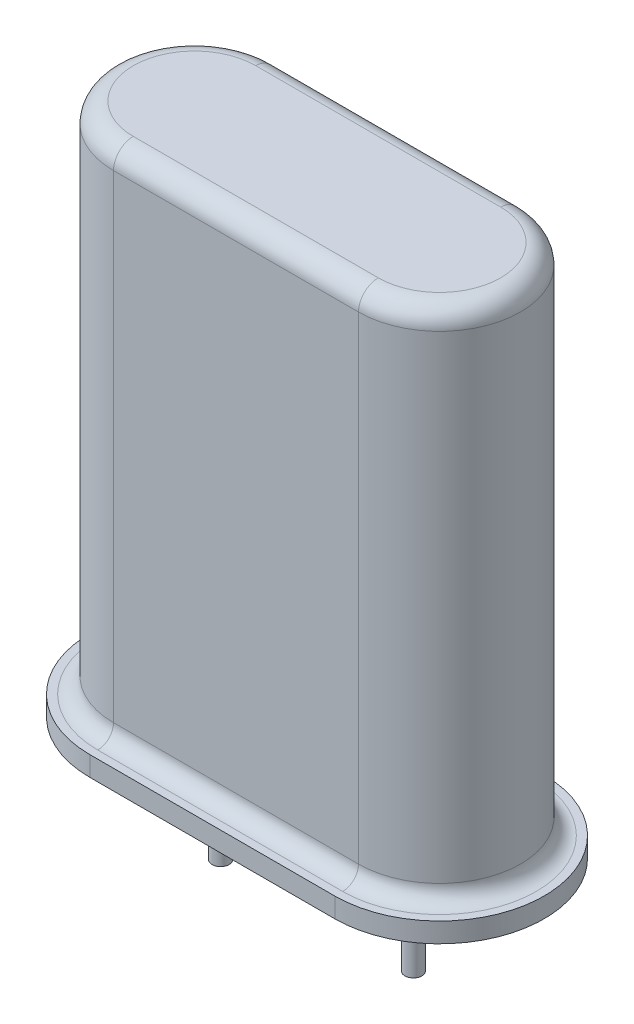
ISO-10303-21;
HEADER;
FILE_DESCRIPTION(('STEP AP214'),'2;1');
FILE_NAME('part.step','',(''),(''),'','','');
FILE_SCHEMA(('AUTOMOTIVE_DESIGN { 1 0 10303 214 1 1 1 1 }'));
ENDSEC;
DATA;
#1=APPLICATION_CONTEXT('core data for automotive mechanical design processes');
#2=APPLICATION_PROTOCOL_DEFINITION('international standard','automotive_design',2000,#1);
#3=PRODUCT_CONTEXT('',#1,'mechanical');
#4=PRODUCT('Part','Part','',(#3));
#5=PRODUCT_RELATED_PRODUCT_CATEGORY('part','',(#4));
#6=PRODUCT_DEFINITION_FORMATION('','',#4);
#7=PRODUCT_DEFINITION_CONTEXT('part definition',#1,'design');
#8=PRODUCT_DEFINITION('design','',#6,#7);
#9=PRODUCT_DEFINITION_SHAPE('','',#8);
#10=(LENGTH_UNIT() NAMED_UNIT(*) SI_UNIT(.MILLI.,.METRE.));
#11=(NAMED_UNIT(*) PLANE_ANGLE_UNIT() SI_UNIT($,.RADIAN.));
#12=(NAMED_UNIT(*) SI_UNIT($,.STERADIAN.) SOLID_ANGLE_UNIT());
#13=UNCERTAINTY_MEASURE_WITH_UNIT(LENGTH_MEASURE(1.E-05),#10,'distance_accuracy_value','');
#14=(GEOMETRIC_REPRESENTATION_CONTEXT(3) GLOBAL_UNCERTAINTY_ASSIGNED_CONTEXT((#13)) GLOBAL_UNIT_ASSIGNED_CONTEXT((#10,
#11,#12)) REPRESENTATION_CONTEXT('',''));
#15=CARTESIAN_POINT('',(0.,0.,0.));
#16=DIRECTION('',(0.,0.,1.));
#17=DIRECTION('',(1.,0.,0.));
#18=AXIS2_PLACEMENT_3D('',#15,#16,#17);
#19=CARTESIAN_POINT('',(-3.1,0.8,0.));
#20=DIRECTION('',(0.,-1.,0.));
#21=DIRECTION('',(0.,0.,-1.));
#22=AXIS2_PLACEMENT_3D('',#19,#20,#21);
#23=PLANE('',#22);
#24=DIRECTION('',(1.,0.,0.));
#25=VECTOR('',#24,1.);
#26=CARTESIAN_POINT('',(-3.1,0.8,2.45));
#27=LINE('',#26,#25);
#28=CARTESIAN_POINT('',(3.1,0.8,2.45));
#29=VERTEX_POINT('',#28);
#30=CARTESIAN_POINT('',(-3.1,0.8,2.45));
#31=VERTEX_POINT('',#30);
#32=EDGE_CURVE('E187',#29,#31,#27,.F.);
#33=ORIENTED_EDGE('',*,*,#32,.T.);
#34=CARTESIAN_POINT('',(-3.1,0.8,0.));
#35=DIRECTION('',(0.,-1.,0.));
#36=DIRECTION('',(0.,0.,-1.));
#37=AXIS2_PLACEMENT_3D('',#34,#35,#36);
#38=CIRCLE('',#37,2.45);
#39=CARTESIAN_POINT('',(-3.1,0.8,-2.45));
#40=VERTEX_POINT('',#39);
#41=EDGE_CURVE('E196',#31,#40,#38,.T.);
#42=ORIENTED_EDGE('',*,*,#41,.T.);
#43=DIRECTION('',(-1.,0.,0.));
#44=VECTOR('',#43,1.);
#45=CARTESIAN_POINT('',(3.1,0.8,-2.45));
#46=LINE('',#45,#44);
#47=CARTESIAN_POINT('',(3.1,0.8,-2.45));
#48=VERTEX_POINT('',#47);
#49=EDGE_CURVE('E193',#40,#48,#46,.F.);
#50=ORIENTED_EDGE('',*,*,#49,.T.);
#51=CARTESIAN_POINT('',(3.1,0.8,0.));
#52=DIRECTION('',(0.,-1.,0.));
#53=DIRECTION('',(0.,0.,-1.));
#54=AXIS2_PLACEMENT_3D('',#51,#52,#53);
#55=CIRCLE('',#54,2.45);
#56=EDGE_CURVE('E190',#48,#29,#55,.T.);
#57=ORIENTED_EDGE('',*,*,#56,.T.);
#58=EDGE_LOOP('',(#33,#42,#50,#57));
#59=FACE_BOUND('',#58,.T.);
#60=CARTESIAN_POINT('',(-3.1,0.8,0.));
#61=DIRECTION('',(0.,1.,0.));
#62=DIRECTION('',(0.,0.,-1.));
#63=AXIS2_PLACEMENT_3D('',#60,#61,#62);
#64=CIRCLE('',#63,2.65);
#65=CARTESIAN_POINT('',(-3.1,0.8,-2.65));
#66=VERTEX_POINT('',#65);
#67=CARTESIAN_POINT('',(-3.1,0.8,2.65));
#68=VERTEX_POINT('',#67);
#69=EDGE_CURVE('E140',#66,#68,#64,.T.);
#70=ORIENTED_EDGE('',*,*,#69,.T.);
#71=DIRECTION('',(1.,0.,0.));
#72=VECTOR('',#71,1.);
#73=CARTESIAN_POINT('',(-3.1,0.8,2.65));
#74=LINE('',#73,#72);
#75=CARTESIAN_POINT('',(3.1,0.8,2.65));
#76=VERTEX_POINT('',#75);
#77=EDGE_CURVE('E128',#68,#76,#74,.T.);
#78=ORIENTED_EDGE('',*,*,#77,.T.);
#79=CARTESIAN_POINT('',(3.1,0.8,0.));
#80=DIRECTION('',(0.,1.,0.));
#81=DIRECTION('',(0.,0.,1.));
#82=AXIS2_PLACEMENT_3D('',#79,#80,#81);
#83=CIRCLE('',#82,2.65);
#84=CARTESIAN_POINT('',(3.1,0.8,-2.65));
#85=VERTEX_POINT('',#84);
#86=EDGE_CURVE('E139',#76,#85,#83,.T.);
#87=ORIENTED_EDGE('',*,*,#86,.T.);
#88=DIRECTION('',(-1.,0.,0.));
#89=VECTOR('',#88,1.);
#90=CARTESIAN_POINT('',(-3.1,0.8,-2.65));
#91=LINE('',#90,#89);
#92=EDGE_CURVE('E144',#85,#66,#91,.T.);
#93=ORIENTED_EDGE('',*,*,#92,.T.);
#94=EDGE_LOOP('',(#70,#78,#87,#93));
#95=FACE_BOUND('',#94,.T.);
#96=ADVANCED_FACE('F38',(#59,#95),#23,.F.);
#97=CARTESIAN_POINT('',(-2.44,-2.5,0.));
#98=DIRECTION('',(0.,-1.,0.));
#99=DIRECTION('',(0.,0.,-1.));
#100=AXIS2_PLACEMENT_3D('',#97,#98,#99);
#101=PLANE('',#100);
#102=CARTESIAN_POINT('',(-2.44,-2.5,0.));
#103=DIRECTION('',(0.,-1.,0.));
#104=DIRECTION('',(0.,0.,-1.));
#105=AXIS2_PLACEMENT_3D('',#102,#103,#104);
#106=CIRCLE('',#105,0.215);
#107=CARTESIAN_POINT('',(-2.44,-2.5,-0.215));
#108=VERTEX_POINT('',#107);
#109=EDGE_CURVE('E175',#108,#108,#106,.T.);
#110=ORIENTED_EDGE('',*,*,#109,.T.);
#111=EDGE_LOOP('',(#110));
#112=FACE_BOUND('',#111,.T.);
#113=ADVANCED_FACE('F331',(#112),#101,.T.);
#114=CARTESIAN_POINT('',(-2.44,-2.5,0.));
#115=DIRECTION('',(0.,-1.,0.));
#116=DIRECTION('',(0.,0.,-1.));
#117=AXIS2_PLACEMENT_3D('',#114,#115,#116);
#118=CYLINDRICAL_SURFACE('',#117,0.215);
#119=CARTESIAN_POINT('',(-2.44,0.,0.));
#120=DIRECTION('',(0.,-1.,0.));
#121=DIRECTION('',(0.,0.,-1.));
#122=AXIS2_PLACEMENT_3D('',#119,#120,#121);
#123=CIRCLE('',#122,0.215);
#124=CARTESIAN_POINT('',(-2.44,0.,-0.215));
#125=VERTEX_POINT('',#124);
#126=EDGE_CURVE('E171',#125,#125,#123,.T.);
#127=ORIENTED_EDGE('',*,*,#126,.T.);
#128=EDGE_LOOP('',(#127));
#129=FACE_BOUND('',#128,.T.);
#130=ORIENTED_EDGE('',*,*,#109,.F.);
#131=EDGE_LOOP('',(#130));
#132=FACE_BOUND('',#131,.T.);
#133=ADVANCED_FACE('F337',(#129,#132),#118,.T.);
#134=CARTESIAN_POINT('',(-2.225,0.,0.));
#135=DIRECTION('',(0.,-1.,0.));
#136=DIRECTION('',(0.,0.,-1.));
#137=AXIS2_PLACEMENT_3D('',#134,#135,#136);
#138=PLANE('',#137);
#139=CARTESIAN_POINT('',(-2.44,0.,0.));
#140=DIRECTION('',(0.,-1.,0.));
#141=DIRECTION('',(0.,0.,-1.));
#142=AXIS2_PLACEMENT_3D('',#139,#140,#141);
#143=CIRCLE('',#142,0.312701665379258);
#144=CARTESIAN_POINT('',(-2.44,0.,-0.312701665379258));
#145=VERTEX_POINT('',#144);
#146=EDGE_CURVE('E161',#145,#145,#143,.T.);
#147=ORIENTED_EDGE('',*,*,#146,.T.);
#148=EDGE_LOOP('',(#147));
#149=FACE_BOUND('',#148,.T.);
#150=ORIENTED_EDGE('',*,*,#126,.F.);
#151=EDGE_LOOP('',(#150));
#152=FACE_BOUND('',#151,.T.);
#153=ADVANCED_FACE('F359',(#149,#152),#138,.T.);
#154=CARTESIAN_POINT('',(-2.44,0.4,0.));
#155=DIRECTION('',(0.,-1.,0.));
#156=DIRECTION('',(0.,0.,-1.));
#157=AXIS2_PLACEMENT_3D('',#154,#155,#156);
#158=DEGENERATE_TOROIDAL_SURFACE('',#157,0.312701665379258,0.4,.T.);
#159=CARTESIAN_POINT('',(-2.44,0.3,0.));
#160=DIRECTION('',(0.,-1.,0.));
#161=DIRECTION('',(0.,0.,-1.));
#162=AXIS2_PLACEMENT_3D('',#159,#160,#161);
#163=CIRCLE('',#162,0.7);
#164=CARTESIAN_POINT('',(-2.44,0.3,-0.7));
#165=VERTEX_POINT('',#164);
#166=EDGE_CURVE('E155',#165,#165,#163,.F.);
#167=ORIENTED_EDGE('',*,*,#166,.F.);
#168=EDGE_LOOP('',(#167));
#169=FACE_BOUND('',#168,.T.);
#170=ORIENTED_EDGE('',*,*,#146,.F.);
#171=EDGE_LOOP('',(#170));
#172=FACE_BOUND('',#171,.T.);
#173=ADVANCED_FACE('F356',(#169,#172),#158,.T.);
#174=CARTESIAN_POINT('',(-3.1,0.8,0.));
#175=DIRECTION('',(0.,-1.,0.));
#176=DIRECTION('',(0.,0.,-1.));
#177=AXIS2_PLACEMENT_3D('',#174,#175,#176);
#178=CYLINDRICAL_SURFACE('',#177,2.65);
#179=CARTESIAN_POINT('',(-3.1,0.3,0.));
#180=DIRECTION('',(0.,1.,0.));
#181=DIRECTION('',(0.,0.,-1.));
#182=AXIS2_PLACEMENT_3D('',#179,#180,#181);
#183=CIRCLE('',#182,2.65);
#184=CARTESIAN_POINT('',(-3.1,0.3,-2.65));
#185=VERTEX_POINT('',#184);
#186=CARTESIAN_POINT('',(-3.1,0.3,2.65));
#187=VERTEX_POINT('',#186);
#188=EDGE_CURVE('E153',#185,#187,#183,.T.);
#189=ORIENTED_EDGE('',*,*,#188,.T.);
#190=DIRECTION('',(0.,-1.,0.));
#191=VECTOR('',#190,1.);
#192=CARTESIAN_POINT('',(-3.1,0.8,2.65));
#193=LINE('',#192,#191);
#194=EDGE_CURVE('E132',#68,#187,#193,.T.);
#195=ORIENTED_EDGE('',*,*,#194,.F.);
#196=ORIENTED_EDGE('',*,*,#69,.F.);
#197=DIRECTION('',(0.,-1.,0.));
#198=VECTOR('',#197,1.);
#199=CARTESIAN_POINT('',(-3.1,0.8,-2.65));
#200=LINE('',#199,#198);
#201=EDGE_CURVE('E302',#66,#185,#200,.T.);
#202=ORIENTED_EDGE('',*,*,#201,.T.);
#203=EDGE_LOOP('',(#189,#195,#196,#202));
#204=FACE_BOUND('',#203,.T.);
#205=ADVANCED_FACE('F151',(#204),#178,.T.);
#206=CARTESIAN_POINT('',(-3.1,0.8,2.65));
#207=DIRECTION('',(0.,0.,-1.));
#208=DIRECTION('',(-1.,0.,0.));
#209=AXIS2_PLACEMENT_3D('',#206,#207,#208);
#210=PLANE('',#209);
#211=DIRECTION('',(1.,0.,0.));
#212=VECTOR('',#211,1.);
#213=CARTESIAN_POINT('',(-3.1,0.3,2.65));
#214=LINE('',#213,#212);
#215=CARTESIAN_POINT('',(3.1,0.3,2.65));
#216=VERTEX_POINT('',#215);
#217=EDGE_CURVE('E304',#187,#216,#214,.T.);
#218=ORIENTED_EDGE('',*,*,#217,.T.);
#219=DIRECTION('',(0.,-1.,0.));
#220=VECTOR('',#219,1.);
#221=CARTESIAN_POINT('',(3.1,0.8,2.65));
#222=LINE('',#221,#220);
#223=EDGE_CURVE('E135',#76,#216,#222,.T.);
#224=ORIENTED_EDGE('',*,*,#223,.F.);
#225=ORIENTED_EDGE('',*,*,#77,.F.);
#226=ORIENTED_EDGE('',*,*,#194,.T.);
#227=EDGE_LOOP('',(#218,#224,#225,#226));
#228=FACE_BOUND('',#227,.T.);
#229=ADVANCED_FACE('F130',(#228),#210,.F.);
#230=CARTESIAN_POINT('',(3.1,0.8,0.));
#231=DIRECTION('',(0.,-1.,0.));
#232=DIRECTION('',(0.,0.,-1.));
#233=AXIS2_PLACEMENT_3D('',#230,#231,#232);
#234=CYLINDRICAL_SURFACE('',#233,2.65);
#235=CARTESIAN_POINT('',(3.1,0.3,0.));
#236=DIRECTION('',(0.,1.,0.));
#237=DIRECTION('',(0.,0.,1.));
#238=AXIS2_PLACEMENT_3D('',#235,#236,#237);
#239=CIRCLE('',#238,2.65);
#240=CARTESIAN_POINT('',(3.1,0.3,-2.65));
#241=VERTEX_POINT('',#240);
#242=EDGE_CURVE('E307',#216,#241,#239,.T.);
#243=ORIENTED_EDGE('',*,*,#242,.T.);
#244=DIRECTION('',(0.,-1.,0.));
#245=VECTOR('',#244,1.);
#246=CARTESIAN_POINT('',(3.1,0.8,-2.65));
#247=LINE('',#246,#245);
#248=EDGE_CURVE('E164',#85,#241,#247,.T.);
#249=ORIENTED_EDGE('',*,*,#248,.F.);
#250=ORIENTED_EDGE('',*,*,#86,.F.);
#251=ORIENTED_EDGE('',*,*,#223,.T.);
#252=EDGE_LOOP('',(#243,#249,#250,#251));
#253=FACE_BOUND('',#252,.T.);
#254=ADVANCED_FACE('F321',(#253),#234,.T.);
#255=CARTESIAN_POINT('',(-3.1,0.8,-2.65));
#256=DIRECTION('',(0.,0.,1.));
#257=DIRECTION('',(1.,0.,0.));
#258=AXIS2_PLACEMENT_3D('',#255,#256,#257);
#259=PLANE('',#258);
#260=DIRECTION('',(-1.,0.,0.));
#261=VECTOR('',#260,1.);
#262=CARTESIAN_POINT('',(-3.1,0.3,-2.65));
#263=LINE('',#262,#261);
#264=EDGE_CURVE('E149',#241,#185,#263,.T.);
#265=ORIENTED_EDGE('',*,*,#264,.T.);
#266=ORIENTED_EDGE('',*,*,#201,.F.);
#267=ORIENTED_EDGE('',*,*,#92,.F.);
#268=ORIENTED_EDGE('',*,*,#248,.T.);
#269=EDGE_LOOP('',(#265,#266,#267,#268));
#270=FACE_BOUND('',#269,.T.);
#271=ADVANCED_FACE('F316',(#270),#259,.F.);
#272=CARTESIAN_POINT('',(-3.1,0.3,0.));
#273=DIRECTION('',(0.,-1.,0.));
#274=DIRECTION('',(0.,0.,-1.));
#275=AXIS2_PLACEMENT_3D('',#272,#273,#274);
#276=PLANE('',#275);
#277=CARTESIAN_POINT('',(2.44,0.3,0.));
#278=DIRECTION('',(0.,-1.,0.));
#279=DIRECTION('',(0.,0.,-1.));
#280=AXIS2_PLACEMENT_3D('',#277,#278,#279);
#281=CIRCLE('',#280,0.7);
#282=CARTESIAN_POINT('',(2.44,0.3,-0.7));
#283=VERTEX_POINT('',#282);
#284=EDGE_CURVE('E179',#283,#283,#281,.T.);
#285=ORIENTED_EDGE('',*,*,#284,.F.);
#286=EDGE_LOOP('',(#285));
#287=FACE_BOUND('',#286,.T.);
#288=ORIENTED_EDGE('',*,*,#166,.T.);
#289=EDGE_LOOP('',(#288));
#290=FACE_BOUND('',#289,.T.);
#291=ORIENTED_EDGE('',*,*,#188,.F.);
#292=ORIENTED_EDGE('',*,*,#264,.F.);
#293=ORIENTED_EDGE('',*,*,#242,.F.);
#294=ORIENTED_EDGE('',*,*,#217,.F.);
#295=EDGE_LOOP('',(#291,#292,#293,#294));
#296=FACE_BOUND('',#295,.T.);
#297=ADVANCED_FACE('F320',(#287,#290,#296),#276,.T.);
#298=CARTESIAN_POINT('',(3.1,38.3860272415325,-2.05));
#299=DIRECTION('',(0.,0.,1.));
#300=DIRECTION('',(1.,0.,0.));
#301=AXIS2_PLACEMENT_3D('',#298,#299,#300);
#302=PLANE('',#301);
#303=DIRECTION('',(0.,-1.,0.));
#304=VECTOR('',#303,1.);
#305=CARTESIAN_POINT('',(-3.1,38.3860272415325,-2.05));
#306=LINE('',#305,#304);
#307=CARTESIAN_POINT('',(-3.1,13.3,-2.05));
#308=VERTEX_POINT('',#307);
#309=CARTESIAN_POINT('',(-3.1,1.2,-2.05));
#310=VERTEX_POINT('',#309);
#311=EDGE_CURVE('E294',#308,#310,#306,.T.);
#312=ORIENTED_EDGE('',*,*,#311,.F.);
#313=DIRECTION('',(1.,0.,0.));
#314=VECTOR('',#313,1.);
#315=CARTESIAN_POINT('',(3.1,13.3,-2.05));
#316=LINE('',#315,#314);
#317=CARTESIAN_POINT('',(3.1,13.3,-2.05));
#318=VERTEX_POINT('',#317);
#319=EDGE_CURVE('E245',#308,#318,#316,.T.);
#320=ORIENTED_EDGE('',*,*,#319,.T.);
#321=DIRECTION('',(0.,-1.,0.));
#322=VECTOR('',#321,1.);
#323=CARTESIAN_POINT('',(3.1,38.3860272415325,-2.05));
#324=LINE('',#323,#322);
#325=CARTESIAN_POINT('',(3.1,1.2,-2.05));
#326=VERTEX_POINT('',#325);
#327=EDGE_CURVE('E283',#318,#326,#324,.T.);
#328=ORIENTED_EDGE('',*,*,#327,.T.);
#329=DIRECTION('',(-1.,0.,0.));
#330=VECTOR('',#329,1.);
#331=CARTESIAN_POINT('',(-3.1,1.2,-2.05));
#332=LINE('',#331,#330);
#333=EDGE_CURVE('E200',#326,#310,#332,.T.);
#334=ORIENTED_EDGE('',*,*,#333,.T.);
#335=EDGE_LOOP('',(#312,#320,#328,#334));
#336=FACE_BOUND('',#335,.T.);
#337=ADVANCED_FACE('F345',(#336),#302,.F.);
#338=CARTESIAN_POINT('',(3.1,38.3860272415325,0.));
#339=DIRECTION('',(0.,-1.,0.));
#340=DIRECTION('',(0.,0.,-1.));
#341=AXIS2_PLACEMENT_3D('',#338,#339,#340);
#342=CYLINDRICAL_SURFACE('',#341,2.05);
#343=ORIENTED_EDGE('',*,*,#327,.F.);
#344=CARTESIAN_POINT('',(3.1,13.3,0.));
#345=DIRECTION('',(0.,-1.,0.));
#346=DIRECTION('',(0.,0.,-1.));
#347=AXIS2_PLACEMENT_3D('',#344,#345,#346);
#348=CIRCLE('',#347,2.05);
#349=CARTESIAN_POINT('',(3.1,13.3,2.05));
#350=VERTEX_POINT('',#349);
#351=EDGE_CURVE('E212',#318,#350,#348,.T.);
#352=ORIENTED_EDGE('',*,*,#351,.T.);
#353=DIRECTION('',(0.,-1.,0.));
#354=VECTOR('',#353,1.);
#355=CARTESIAN_POINT('',(3.1,38.3860272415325,2.05));
#356=LINE('',#355,#354);
#357=CARTESIAN_POINT('',(3.1,1.2,2.05));
#358=VERTEX_POINT('',#357);
#359=EDGE_CURVE('E282',#350,#358,#356,.T.);
#360=ORIENTED_EDGE('',*,*,#359,.T.);
#361=CARTESIAN_POINT('',(3.1,1.2,0.));
#362=DIRECTION('',(0.,-1.,0.));
#363=DIRECTION('',(0.,0.,-1.));
#364=AXIS2_PLACEMENT_3D('',#361,#362,#363);
#365=CIRCLE('',#364,2.05);
#366=EDGE_CURVE('E204',#358,#326,#365,.F.);
#367=ORIENTED_EDGE('',*,*,#366,.T.);
#368=EDGE_LOOP('',(#343,#352,#360,#367));
#369=FACE_BOUND('',#368,.T.);
#370=ADVANCED_FACE('F281',(#369),#342,.T.);
#371=CARTESIAN_POINT('',(-3.1,38.3860272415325,2.05));
#372=DIRECTION('',(0.,0.,-1.));
#373=DIRECTION('',(-1.,0.,0.));
#374=AXIS2_PLACEMENT_3D('',#371,#372,#373);
#375=PLANE('',#374);
#376=ORIENTED_EDGE('',*,*,#359,.F.);
#377=DIRECTION('',(-1.,0.,0.));
#378=VECTOR('',#377,1.);
#379=CARTESIAN_POINT('',(-3.1,13.3,2.05));
#380=LINE('',#379,#378);
#381=CARTESIAN_POINT('',(-3.1,13.3,2.05));
#382=VERTEX_POINT('',#381);
#383=EDGE_CURVE('E12',#350,#382,#380,.T.);
#384=ORIENTED_EDGE('',*,*,#383,.T.);
#385=DIRECTION('',(0.,-1.,0.));
#386=VECTOR('',#385,1.);
#387=CARTESIAN_POINT('',(-3.1,38.3860272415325,2.05));
#388=LINE('',#387,#386);
#389=CARTESIAN_POINT('',(-3.1,1.2,2.05));
#390=VERTEX_POINT('',#389);
#391=EDGE_CURVE('E288',#382,#390,#388,.T.);
#392=ORIENTED_EDGE('',*,*,#391,.T.);
#393=DIRECTION('',(1.,0.,0.));
#394=VECTOR('',#393,1.);
#395=CARTESIAN_POINT('',(3.1,1.2,2.05));
#396=LINE('',#395,#394);
#397=EDGE_CURVE('E208',#390,#358,#396,.T.);
#398=ORIENTED_EDGE('',*,*,#397,.T.);
#399=EDGE_LOOP('',(#376,#384,#392,#398));
#400=FACE_BOUND('',#399,.T.);
#401=ADVANCED_FACE('F284',(#400),#375,.F.);
#402=CARTESIAN_POINT('',(-3.1,38.3860272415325,0.));
#403=DIRECTION('',(0.,-1.,0.));
#404=DIRECTION('',(0.,0.,-1.));
#405=AXIS2_PLACEMENT_3D('',#402,#403,#404);
#406=CYLINDRICAL_SURFACE('',#405,2.05);
#407=ORIENTED_EDGE('',*,*,#391,.F.);
#408=CARTESIAN_POINT('',(-3.1,13.3,0.));
#409=DIRECTION('',(0.,-1.,0.));
#410=DIRECTION('',(0.,0.,-1.));
#411=AXIS2_PLACEMENT_3D('',#408,#409,#410);
#412=CIRCLE('',#411,2.05);
#413=EDGE_CURVE('E48',#382,#308,#412,.T.);
#414=ORIENTED_EDGE('',*,*,#413,.T.);
#415=ORIENTED_EDGE('',*,*,#311,.T.);
#416=CARTESIAN_POINT('',(-3.1,1.2,0.));
#417=DIRECTION('',(0.,-1.,0.));
#418=DIRECTION('',(0.,0.,-1.));
#419=AXIS2_PLACEMENT_3D('',#416,#417,#418);
#420=CIRCLE('',#419,2.05);
#421=EDGE_CURVE('E183',#310,#390,#420,.F.);
#422=ORIENTED_EDGE('',*,*,#421,.T.);
#423=EDGE_LOOP('',(#407,#414,#415,#422));
#424=FACE_BOUND('',#423,.T.);
#425=ADVANCED_FACE('F342',(#424),#406,.T.);
#426=CARTESIAN_POINT('',(-3.1,13.8,0.));
#427=DIRECTION('',(0.,-1.,0.));
#428=DIRECTION('',(0.,0.,-1.));
#429=AXIS2_PLACEMENT_3D('',#426,#427,#428);
#430=PLANE('',#429);
#431=DIRECTION('',(-1.,0.,0.));
#432=VECTOR('',#431,1.);
#433=CARTESIAN_POINT('',(-3.1,13.8,1.55));
#434=LINE('',#433,#432);
#435=CARTESIAN_POINT('',(-3.1,13.8,1.55));
#436=VERTEX_POINT('',#435);
#437=CARTESIAN_POINT('',(3.1,13.8,1.55));
#438=VERTEX_POINT('',#437);
#439=EDGE_CURVE('E232',#436,#438,#434,.F.);
#440=ORIENTED_EDGE('',*,*,#439,.T.);
#441=CARTESIAN_POINT('',(3.1,13.8,0.));
#442=DIRECTION('',(0.,-1.,0.));
#443=DIRECTION('',(0.,0.,-1.));
#444=AXIS2_PLACEMENT_3D('',#441,#442,#443);
#445=CIRCLE('',#444,1.55);
#446=CARTESIAN_POINT('',(3.1,13.8,-1.55));
#447=VERTEX_POINT('',#446);
#448=EDGE_CURVE('E241',#438,#447,#445,.F.);
#449=ORIENTED_EDGE('',*,*,#448,.T.);
#450=DIRECTION('',(1.,0.,0.));
#451=VECTOR('',#450,1.);
#452=CARTESIAN_POINT('',(-3.1,13.8,-1.55));
#453=LINE('',#452,#451);
#454=CARTESIAN_POINT('',(-3.1,13.8,-1.55));
#455=VERTEX_POINT('',#454);
#456=EDGE_CURVE('E238',#447,#455,#453,.F.);
#457=ORIENTED_EDGE('',*,*,#456,.T.);
#458=CARTESIAN_POINT('',(-3.1,13.8,0.));
#459=DIRECTION('',(0.,-1.,0.));
#460=DIRECTION('',(0.,0.,-1.));
#461=AXIS2_PLACEMENT_3D('',#458,#459,#460);
#462=CIRCLE('',#461,1.55);
#463=EDGE_CURVE('E235',#455,#436,#462,.F.);
#464=ORIENTED_EDGE('',*,*,#463,.T.);
#465=EDGE_LOOP('',(#440,#449,#457,#464));
#466=FACE_BOUND('',#465,.T.);
#467=ADVANCED_FACE('F272',(#466),#430,.F.);
#468=CARTESIAN_POINT('',(2.44,-2.5,0.));
#469=DIRECTION('',(0.,-1.,0.));
#470=DIRECTION('',(0.,0.,-1.));
#471=AXIS2_PLACEMENT_3D('',#468,#469,#470);
#472=PLANE('',#471);
#473=CARTESIAN_POINT('',(2.44,-2.5,0.));
#474=DIRECTION('',(0.,1.,0.));
#475=DIRECTION('',(0.,0.,-1.));
#476=AXIS2_PLACEMENT_3D('',#473,#474,#475);
#477=CIRCLE('',#476,0.215);
#478=CARTESIAN_POINT('',(2.44,-2.5,-0.215));
#479=VERTEX_POINT('',#478);
#480=EDGE_CURVE('E612',#479,#479,#477,.T.);
#481=ORIENTED_EDGE('',*,*,#480,.F.);
#482=EDGE_LOOP('',(#481));
#483=FACE_BOUND('',#482,.T.);
#484=ADVANCED_FACE('F432',(#483),#472,.T.);
#485=CARTESIAN_POINT('',(2.44,-2.5,0.));
#486=DIRECTION('',(0.,-1.,0.));
#487=DIRECTION('',(0.,0.,-1.));
#488=AXIS2_PLACEMENT_3D('',#485,#486,#487);
#489=CYLINDRICAL_SURFACE('',#488,0.215);
#490=CARTESIAN_POINT('',(2.44,0.,0.));
#491=DIRECTION('',(0.,1.,0.));
#492=DIRECTION('',(0.,0.,-1.));
#493=AXIS2_PLACEMENT_3D('',#490,#491,#492);
#494=CIRCLE('',#493,0.215);
#495=CARTESIAN_POINT('',(2.44,0.,-0.215));
#496=VERTEX_POINT('',#495);
#497=EDGE_CURVE('E615',#496,#496,#494,.T.);
#498=ORIENTED_EDGE('',*,*,#497,.F.);
#499=EDGE_LOOP('',(#498));
#500=FACE_BOUND('',#499,.T.);
#501=ORIENTED_EDGE('',*,*,#480,.T.);
#502=EDGE_LOOP('',(#501));
#503=FACE_BOUND('',#502,.T.);
#504=ADVANCED_FACE('F425',(#500,#503),#489,.T.);
#505=CARTESIAN_POINT('',(2.225,0.,0.));
#506=DIRECTION('',(0.,-1.,0.));
#507=DIRECTION('',(0.,0.,-1.));
#508=AXIS2_PLACEMENT_3D('',#505,#506,#507);
#509=PLANE('',#508);
#510=CARTESIAN_POINT('',(2.44,0.,0.));
#511=DIRECTION('',(0.,1.,0.));
#512=DIRECTION('',(0.,0.,-1.));
#513=AXIS2_PLACEMENT_3D('',#510,#511,#512);
#514=CIRCLE('',#513,0.312701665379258);
#515=CARTESIAN_POINT('',(2.44,0.,-0.312701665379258));
#516=VERTEX_POINT('',#515);
#517=EDGE_CURVE('E228',#516,#516,#514,.T.);
#518=ORIENTED_EDGE('',*,*,#517,.F.);
#519=EDGE_LOOP('',(#518));
#520=FACE_BOUND('',#519,.T.);
#521=ORIENTED_EDGE('',*,*,#497,.T.);
#522=EDGE_LOOP('',(#521));
#523=FACE_BOUND('',#522,.T.);
#524=ADVANCED_FACE('F418',(#520,#523),#509,.T.);
#525=CARTESIAN_POINT('',(2.44,0.4,0.));
#526=DIRECTION('',(0.,-1.,0.));
#527=DIRECTION('',(0.,0.,-1.));
#528=AXIS2_PLACEMENT_3D('',#525,#526,#527);
#529=DEGENERATE_TOROIDAL_SURFACE('',#528,0.312701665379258,0.4,.T.);
#530=ORIENTED_EDGE('',*,*,#284,.T.);
#531=EDGE_LOOP('',(#530));
#532=FACE_BOUND('',#531,.T.);
#533=ORIENTED_EDGE('',*,*,#517,.T.);
#534=EDGE_LOOP('',(#533));
#535=FACE_BOUND('',#534,.T.);
#536=ADVANCED_FACE('F390',(#532,#535),#529,.T.);
#537=CARTESIAN_POINT('',(3.1,1.2,0.));
#538=DIRECTION('',(0.,-1.,0.));
#539=DIRECTION('',(0.,0.,-1.));
#540=AXIS2_PLACEMENT_3D('',#537,#538,#539);
#541=TOROIDAL_SURFACE('',#540,2.45,0.4);
#542=CARTESIAN_POINT('',(3.1,1.2,2.45));
#543=DIRECTION('',(1.,0.,0.));
#544=DIRECTION('',(0.,0.,-1.));
#545=AXIS2_PLACEMENT_3D('',#542,#543,#544);
#546=CIRCLE('',#545,0.4);
#547=EDGE_CURVE('E220',#29,#358,#546,.T.);
#548=ORIENTED_EDGE('',*,*,#547,.F.);
#549=ORIENTED_EDGE('',*,*,#56,.F.);
#550=CARTESIAN_POINT('',(3.1,1.2,-2.45));
#551=DIRECTION('',(1.,0.,0.));
#552=DIRECTION('',(0.,0.,-1.));
#553=AXIS2_PLACEMENT_3D('',#550,#551,#552);
#554=CIRCLE('',#553,0.4);
#555=EDGE_CURVE('E224',#326,#48,#554,.T.);
#556=ORIENTED_EDGE('',*,*,#555,.F.);
#557=ORIENTED_EDGE('',*,*,#366,.F.);
#558=EDGE_LOOP('',(#548,#549,#556,#557));
#559=FACE_BOUND('',#558,.T.);
#560=ADVANCED_FACE('F386',(#559),#541,.F.);
#561=CARTESIAN_POINT('',(3.1,1.2,-2.45));
#562=DIRECTION('',(1.,0.,0.));
#563=DIRECTION('',(0.,0.,-1.));
#564=AXIS2_PLACEMENT_3D('',#561,#562,#563);
#565=CYLINDRICAL_SURFACE('',#564,0.4);
#566=ORIENTED_EDGE('',*,*,#555,.T.);
#567=ORIENTED_EDGE('',*,*,#49,.F.);
#568=CARTESIAN_POINT('',(-3.1,1.2,-2.45));
#569=DIRECTION('',(1.,0.,0.));
#570=DIRECTION('',(0.,0.,-1.));
#571=AXIS2_PLACEMENT_3D('',#568,#569,#570);
#572=CIRCLE('',#571,0.4);
#573=EDGE_CURVE('E217',#310,#40,#572,.T.);
#574=ORIENTED_EDGE('',*,*,#573,.F.);
#575=ORIENTED_EDGE('',*,*,#333,.F.);
#576=EDGE_LOOP('',(#566,#567,#574,#575));
#577=FACE_BOUND('',#576,.T.);
#578=ADVANCED_FACE('F382',(#577),#565,.F.);
#579=CARTESIAN_POINT('',(-3.1,1.2,2.45));
#580=DIRECTION('',(-1.,0.,0.));
#581=DIRECTION('',(0.,0.,1.));
#582=AXIS2_PLACEMENT_3D('',#579,#580,#581);
#583=CYLINDRICAL_SURFACE('',#582,0.4);
#584=ORIENTED_EDGE('',*,*,#547,.T.);
#585=ORIENTED_EDGE('',*,*,#397,.F.);
#586=CARTESIAN_POINT('',(-3.1,1.2,2.45));
#587=DIRECTION('',(1.,0.,0.));
#588=DIRECTION('',(0.,0.,-1.));
#589=AXIS2_PLACEMENT_3D('',#586,#587,#588);
#590=CIRCLE('',#589,0.4);
#591=EDGE_CURVE('E213',#31,#390,#590,.T.);
#592=ORIENTED_EDGE('',*,*,#591,.F.);
#593=ORIENTED_EDGE('',*,*,#32,.F.);
#594=EDGE_LOOP('',(#584,#585,#592,#593));
#595=FACE_BOUND('',#594,.T.);
#596=ADVANCED_FACE('F378',(#595),#583,.F.);
#597=CARTESIAN_POINT('',(-3.1,1.2,0.));
#598=DIRECTION('',(0.,-1.,0.));
#599=DIRECTION('',(0.,0.,-1.));
#600=AXIS2_PLACEMENT_3D('',#597,#598,#599);
#601=TOROIDAL_SURFACE('',#600,2.45,0.4);
#602=ORIENTED_EDGE('',*,*,#573,.T.);
#603=ORIENTED_EDGE('',*,*,#41,.F.);
#604=ORIENTED_EDGE('',*,*,#591,.T.);
#605=ORIENTED_EDGE('',*,*,#421,.F.);
#606=EDGE_LOOP('',(#602,#603,#604,#605));
#607=FACE_BOUND('',#606,.T.);
#608=ADVANCED_FACE('F375',(#607),#601,.F.);
#609=CARTESIAN_POINT('',(-3.1,13.3,0.));
#610=DIRECTION('',(0.,-1.,0.));
#611=DIRECTION('',(0.,0.,-1.));
#612=AXIS2_PLACEMENT_3D('',#609,#610,#611);
#613=TOROIDAL_SURFACE('',#612,1.55,0.5);
#614=CARTESIAN_POINT('',(-3.1,13.3,1.55));
#615=DIRECTION('',(1.,0.,0.));
#616=DIRECTION('',(0.,0.,-1.));
#617=AXIS2_PLACEMENT_3D('',#614,#615,#616);
#618=CIRCLE('',#617,0.5);
#619=EDGE_CURVE('E254',#436,#382,#618,.T.);
#620=ORIENTED_EDGE('',*,*,#619,.F.);
#621=ORIENTED_EDGE('',*,*,#463,.F.);
#622=CARTESIAN_POINT('',(-3.1,13.3,-1.55));
#623=DIRECTION('',(1.,0.,0.));
#624=DIRECTION('',(0.,0.,-1.));
#625=AXIS2_PLACEMENT_3D('',#622,#623,#624);
#626=CIRCLE('',#625,0.5);
#627=EDGE_CURVE('E42',#308,#455,#626,.T.);
#628=ORIENTED_EDGE('',*,*,#627,.F.);
#629=ORIENTED_EDGE('',*,*,#413,.F.);
#630=EDGE_LOOP('',(#620,#621,#628,#629));
#631=FACE_BOUND('',#630,.T.);
#632=ADVANCED_FACE('F40',(#631),#613,.T.);
#633=CARTESIAN_POINT('',(3.1,13.3,-1.55));
#634=DIRECTION('',(1.,0.,0.));
#635=DIRECTION('',(0.,0.,-1.));
#636=AXIS2_PLACEMENT_3D('',#633,#634,#635);
#637=CYLINDRICAL_SURFACE('',#636,0.5);
#638=ORIENTED_EDGE('',*,*,#627,.T.);
#639=ORIENTED_EDGE('',*,*,#456,.F.);
#640=CARTESIAN_POINT('',(3.1,13.3,-1.55));
#641=DIRECTION('',(1.,0.,0.));
#642=DIRECTION('',(0.,0.,-1.));
#643=AXIS2_PLACEMENT_3D('',#640,#641,#642);
#644=CIRCLE('',#643,0.5);
#645=EDGE_CURVE('E253',#318,#447,#644,.T.);
#646=ORIENTED_EDGE('',*,*,#645,.F.);
#647=ORIENTED_EDGE('',*,*,#319,.F.);
#648=EDGE_LOOP('',(#638,#639,#646,#647));
#649=FACE_BOUND('',#648,.T.);
#650=ADVANCED_FACE('F267',(#649),#637,.T.);
#651=CARTESIAN_POINT('',(-3.1,13.3,1.55));
#652=DIRECTION('',(-1.,0.,0.));
#653=DIRECTION('',(0.,0.,1.));
#654=AXIS2_PLACEMENT_3D('',#651,#652,#653);
#655=CYLINDRICAL_SURFACE('',#654,0.5);
#656=ORIENTED_EDGE('',*,*,#619,.T.);
#657=ORIENTED_EDGE('',*,*,#383,.F.);
#658=CARTESIAN_POINT('',(3.1,13.3,1.55));
#659=DIRECTION('',(1.,0.,0.));
#660=DIRECTION('',(0.,0.,-1.));
#661=AXIS2_PLACEMENT_3D('',#658,#659,#660);
#662=CIRCLE('',#661,0.5);
#663=EDGE_CURVE('E250',#438,#350,#662,.T.);
#664=ORIENTED_EDGE('',*,*,#663,.F.);
#665=ORIENTED_EDGE('',*,*,#439,.F.);
#666=EDGE_LOOP('',(#656,#657,#664,#665));
#667=FACE_BOUND('',#666,.T.);
#668=ADVANCED_FACE('F278',(#667),#655,.T.);
#669=CARTESIAN_POINT('',(3.1,13.3,0.));
#670=DIRECTION('',(0.,-1.,0.));
#671=DIRECTION('',(0.,0.,-1.));
#672=AXIS2_PLACEMENT_3D('',#669,#670,#671);
#673=TOROIDAL_SURFACE('',#672,1.55,0.5);
#674=ORIENTED_EDGE('',*,*,#645,.T.);
#675=ORIENTED_EDGE('',*,*,#448,.F.);
#676=ORIENTED_EDGE('',*,*,#663,.T.);
#677=ORIENTED_EDGE('',*,*,#351,.F.);
#678=EDGE_LOOP('',(#674,#675,#676,#677));
#679=FACE_BOUND('',#678,.T.);
#680=ADVANCED_FACE('F276',(#679),#673,.T.);
#681=CLOSED_SHELL('',(#96,#113,#133,#153,#173,#205,#229,#254,#271,#297,#337,#370,#401,#425,#467,
#484,#504,#524,#536,#560,#578,#596,#608,#632,#650,#668,#680));
#682=MANIFOLD_SOLID_BREP('B2',#681);
#683=ADVANCED_BREP_SHAPE_REPRESENTATION('',(#18,#682),#14);
#684=SHAPE_DEFINITION_REPRESENTATION(#9,#683);
ENDSEC;
END-ISO-10303-21;
